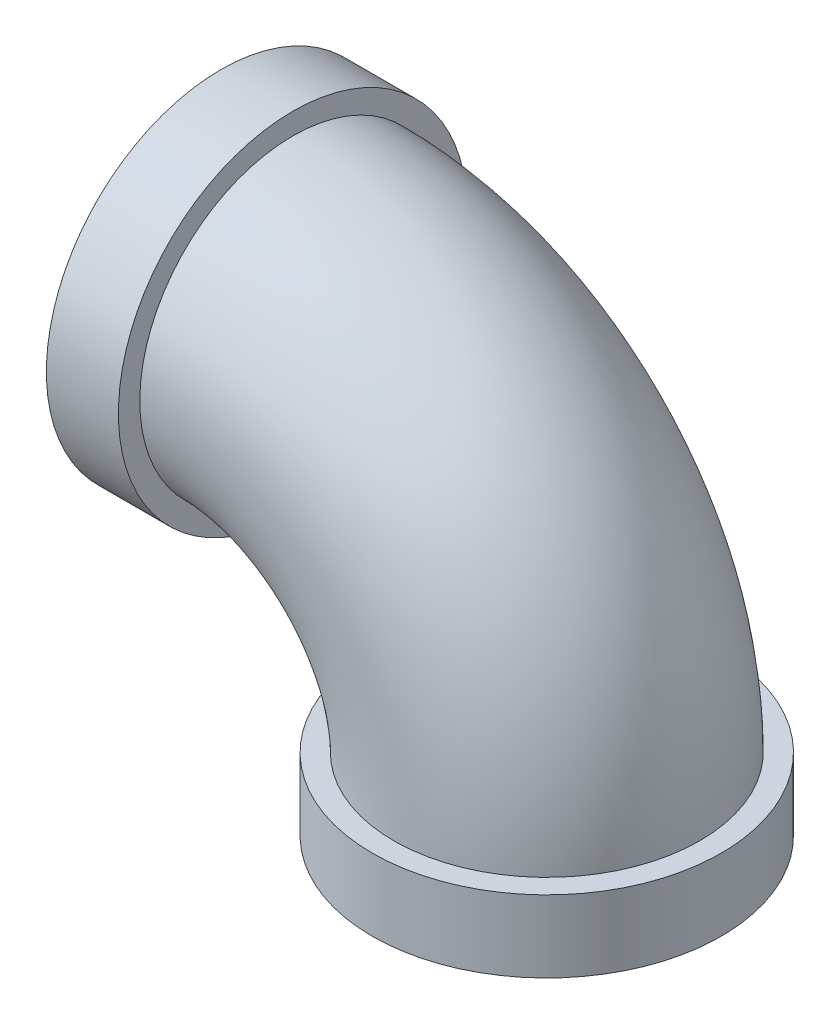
ISO-10303-21;
HEADER;
FILE_DESCRIPTION(('STEP AP214'),'2;1');
FILE_NAME('part.step','',(''),(''),'','','');
FILE_SCHEMA(('AUTOMOTIVE_DESIGN { 1 0 10303 214 1 1 1 1 }'));
ENDSEC;
DATA;
#1=APPLICATION_CONTEXT('core data for automotive mechanical design processes');
#2=APPLICATION_PROTOCOL_DEFINITION('international standard','automotive_design',2000,#1);
#3=PRODUCT_CONTEXT('',#1,'mechanical');
#4=PRODUCT('Part','Part','',(#3));
#5=PRODUCT_RELATED_PRODUCT_CATEGORY('part','',(#4));
#6=PRODUCT_DEFINITION_FORMATION('','',#4);
#7=PRODUCT_DEFINITION_CONTEXT('part definition',#1,'design');
#8=PRODUCT_DEFINITION('design','',#6,#7);
#9=PRODUCT_DEFINITION_SHAPE('','',#8);
#10=(LENGTH_UNIT() NAMED_UNIT(*) SI_UNIT(.MILLI.,.METRE.));
#11=(NAMED_UNIT(*) PLANE_ANGLE_UNIT() SI_UNIT($,.RADIAN.));
#12=(NAMED_UNIT(*) SI_UNIT($,.STERADIAN.) SOLID_ANGLE_UNIT());
#13=UNCERTAINTY_MEASURE_WITH_UNIT(LENGTH_MEASURE(1.E-05),#10,'distance_accuracy_value','');
#14=(GEOMETRIC_REPRESENTATION_CONTEXT(3) GLOBAL_UNCERTAINTY_ASSIGNED_CONTEXT((#13)) GLOBAL_UNIT_ASSIGNED_CONTEXT((#10,
#11,#12)) REPRESENTATION_CONTEXT('',''));
#15=CARTESIAN_POINT('',(0.,0.,0.));
#16=DIRECTION('',(0.,0.,1.));
#17=DIRECTION('',(1.,0.,0.));
#18=AXIS2_PLACEMENT_3D('',#15,#16,#17);
#19=CARTESIAN_POINT('',(0.,0.,0.));
#20=DIRECTION('',(0.,0.,-1.));
#21=DIRECTION('',(-1.,0.,0.));
#22=AXIS2_PLACEMENT_3D('',#19,#20,#21);
#23=TOROIDAL_SURFACE('',#22,22.1234,7.62);
#24=CARTESIAN_POINT('',(0.,22.1234,0.));
#25=DIRECTION('',(-1.,0.,0.));
#26=DIRECTION('',(0.,-1.,0.));
#27=AXIS2_PLACEMENT_3D('',#24,#25,#26);
#28=CIRCLE('',#27,7.62);
#29=CARTESIAN_POINT('',(-1.10452887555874E-13,29.7434,0.));
#30=VERTEX_POINT('',#29);
#31=EDGE_CURVE('E63',#30,#30,#28,.T.);
#32=CARTESIAN_POINT('',(22.1234,0.,0.));
#33=DIRECTION('',(0.,-1.,0.));
#34=DIRECTION('',(0.,0.,-1.));
#35=AXIS2_PLACEMENT_3D('',#32,#33,#34);
#36=CIRCLE('',#35,7.62);
#37=CARTESIAN_POINT('',(29.7434,0.,0.));
#38=VERTEX_POINT('',#37);
#39=EDGE_CURVE('E49',#38,#38,#36,.T.);
#40=CARTESIAN_POINT('',(0.,0.,0.));
#41=DIRECTION('',(0.,0.,-1.));
#42=DIRECTION('',(-1.,0.,0.));
#43=AXIS2_PLACEMENT_3D('',#40,#41,#42);
#44=CIRCLE('',#43,29.7434);
#45=EDGE_CURVE('',#30,#38,#44,.T.);
#46=ORIENTED_EDGE('',*,*,#31,.T.);
#47=ORIENTED_EDGE('',*,*,#39,.T.);
#48=ORIENTED_EDGE('',*,*,#45,.T.);
#49=ORIENTED_EDGE('',*,*,#45,.F.);
#50=EDGE_LOOP('',(#46,#48,#47,#49));
#51=FACE_BOUND('',#50,.T.);
#52=ADVANCED_FACE('F30',(#51),#23,.F.);
#53=CARTESIAN_POINT('',(0.,0.,0.));
#54=DIRECTION('',(0.,0.,-1.));
#55=DIRECTION('',(-1.,0.,0.));
#56=AXIS2_PLACEMENT_3D('',#53,#54,#55);
#57=TOROIDAL_SURFACE('',#56,22.1234,13.335);
#58=CARTESIAN_POINT('',(0.,22.1234,0.));
#59=DIRECTION('',(-1.,0.,0.));
#60=DIRECTION('',(0.,0.,1.));
#61=AXIS2_PLACEMENT_3D('',#58,#59,#60);
#62=CIRCLE('',#61,13.335);
#63=CARTESIAN_POINT('',(-1.31675688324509E-13,35.4584,0.));
#64=VERTEX_POINT('',#63);
#65=EDGE_CURVE('E10',#64,#64,#62,.T.);
#66=CARTESIAN_POINT('',(22.1234,0.,0.));
#67=DIRECTION('',(0.,-1.,0.));
#68=DIRECTION('',(0.,0.,-1.));
#69=AXIS2_PLACEMENT_3D('',#66,#67,#68);
#70=CIRCLE('',#69,13.335);
#71=CARTESIAN_POINT('',(35.4584,0.,0.));
#72=VERTEX_POINT('',#71);
#73=EDGE_CURVE('E37',#72,#72,#70,.T.);
#74=CARTESIAN_POINT('',(0.,0.,0.));
#75=DIRECTION('',(0.,0.,-1.));
#76=DIRECTION('',(-1.,0.,0.));
#77=AXIS2_PLACEMENT_3D('',#74,#75,#76);
#78=CIRCLE('',#77,35.4584);
#79=EDGE_CURVE('',#64,#72,#78,.T.);
#80=ORIENTED_EDGE('',*,*,#65,.F.);
#81=ORIENTED_EDGE('',*,*,#73,.F.);
#82=ORIENTED_EDGE('',*,*,#79,.T.);
#83=ORIENTED_EDGE('',*,*,#79,.F.);
#84=EDGE_LOOP('',(#80,#82,#81,#83));
#85=FACE_BOUND('',#84,.T.);
#86=ADVANCED_FACE('F32',(#85),#57,.T.);
#87=CARTESIAN_POINT('',(22.1234,-6.2738,0.));
#88=DIRECTION('',(0.,-1.,0.));
#89=DIRECTION('',(0.,0.,-1.));
#90=AXIS2_PLACEMENT_3D('',#87,#88,#89);
#91=PLANE('',#90);
#92=CARTESIAN_POINT('',(22.1234,-6.2738,0.));
#93=DIRECTION('',(0.,-1.,0.));
#94=DIRECTION('',(0.,0.,-1.));
#95=AXIS2_PLACEMENT_3D('',#92,#93,#94);
#96=CIRCLE('',#95,11.0998);
#97=CARTESIAN_POINT('',(22.1234,-6.2738,-11.0998));
#98=VERTEX_POINT('',#97);
#99=EDGE_CURVE('E56',#98,#98,#96,.T.);
#100=ORIENTED_EDGE('',*,*,#99,.F.);
#101=EDGE_LOOP('',(#100));
#102=FACE_BOUND('',#101,.T.);
#103=CARTESIAN_POINT('',(22.1234,-6.2738,0.));
#104=DIRECTION('',(0.,-1.,0.));
#105=DIRECTION('',(0.,0.,-1.));
#106=AXIS2_PLACEMENT_3D('',#103,#104,#105);
#107=CIRCLE('',#106,15.2019);
#108=CARTESIAN_POINT('',(22.1234,-6.2738,15.2019));
#109=VERTEX_POINT('',#108);
#110=EDGE_CURVE('E41',#109,#109,#107,.T.);
#111=ORIENTED_EDGE('',*,*,#110,.T.);
#112=EDGE_LOOP('',(#111));
#113=FACE_BOUND('',#112,.T.);
#114=ADVANCED_FACE('F104',(#102,#113),#91,.T.);
#115=CARTESIAN_POINT('',(22.1234,-6.2738,0.));
#116=DIRECTION('',(0.,1.,0.));
#117=DIRECTION('',(0.,0.,1.));
#118=AXIS2_PLACEMENT_3D('',#115,#116,#117);
#119=CYLINDRICAL_SURFACE('',#118,15.2019);
#120=CARTESIAN_POINT('',(22.1234,0.,0.));
#121=DIRECTION('',(0.,-1.,0.));
#122=DIRECTION('',(0.,0.,-1.));
#123=AXIS2_PLACEMENT_3D('',#120,#121,#122);
#124=CIRCLE('',#123,15.2019);
#125=CARTESIAN_POINT('',(22.1234,0.,15.2019));
#126=VERTEX_POINT('',#125);
#127=EDGE_CURVE('E45',#126,#126,#124,.T.);
#128=CARTESIAN_POINT('',(22.1234,-6.2738,15.2019));
#129=CARTESIAN_POINT('',(22.1234,-6.20844791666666,15.2019));
#130=CARTESIAN_POINT('',(22.1234,-6.14309583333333,15.2019));
#131=CARTESIAN_POINT('',(22.1234,-6.01239166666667,15.2019));
#132=CARTESIAN_POINT('',(22.1234,-5.94703958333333,15.2019));
#133=CARTESIAN_POINT('',(22.1234,-5.81633541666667,15.2019));
#134=CARTESIAN_POINT('',(22.1234,-5.75098333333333,15.2019));
#135=CARTESIAN_POINT('',(22.1234,-5.62027916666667,15.2019));
#136=CARTESIAN_POINT('',(22.1234,-5.55492708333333,15.2019));
#137=CARTESIAN_POINT('',(22.1234,-5.42422291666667,15.2019));
#138=CARTESIAN_POINT('',(22.1234,-5.35887083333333,15.2019));
#139=CARTESIAN_POINT('',(22.1234,-5.22816666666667,15.2019));
#140=CARTESIAN_POINT('',(22.1234,-5.16281458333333,15.2019));
#141=CARTESIAN_POINT('',(22.1234,-5.03211041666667,15.2019));
#142=CARTESIAN_POINT('',(22.1234,-4.96675833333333,15.2019));
#143=CARTESIAN_POINT('',(22.1234,-4.83605416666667,15.2019));
#144=CARTESIAN_POINT('',(22.1234,-4.77070208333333,15.2019));
#145=CARTESIAN_POINT('',(22.1234,-4.63999791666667,15.2019));
#146=CARTESIAN_POINT('',(22.1234,-4.57464583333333,15.2019));
#147=CARTESIAN_POINT('',(22.1234,-4.44394166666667,15.2019));
#148=CARTESIAN_POINT('',(22.1234,-4.37858958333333,15.2019));
#149=CARTESIAN_POINT('',(22.1234,-4.24788541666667,15.2019));
#150=CARTESIAN_POINT('',(22.1234,-4.18253333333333,15.2019));
#151=CARTESIAN_POINT('',(22.1234,-4.05182916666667,15.2019));
#152=CARTESIAN_POINT('',(22.1234,-3.98647708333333,15.2019));
#153=CARTESIAN_POINT('',(22.1234,-3.85577291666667,15.2019));
#154=CARTESIAN_POINT('',(22.1234,-3.79042083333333,15.2019));
#155=CARTESIAN_POINT('',(22.1234,-3.65971666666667,15.2019));
#156=CARTESIAN_POINT('',(22.1234,-3.59436458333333,15.2019));
#157=CARTESIAN_POINT('',(22.1234,-3.46366041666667,15.2019));
#158=CARTESIAN_POINT('',(22.1234,-3.39830833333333,15.2019));
#159=CARTESIAN_POINT('',(22.1234,-3.26760416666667,15.2019));
#160=CARTESIAN_POINT('',(22.1234,-3.20225208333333,15.2019));
#161=CARTESIAN_POINT('',(22.1234,-3.07154791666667,15.2019));
#162=CARTESIAN_POINT('',(22.1234,-3.00619583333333,15.2019));
#163=CARTESIAN_POINT('',(22.1234,-2.87549166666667,15.2019));
#164=CARTESIAN_POINT('',(22.1234,-2.81013958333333,15.2019));
#165=CARTESIAN_POINT('',(22.1234,-2.67943541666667,15.2019));
#166=CARTESIAN_POINT('',(22.1234,-2.61408333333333,15.2019));
#167=CARTESIAN_POINT('',(22.1234,-2.48337916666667,15.2019));
#168=CARTESIAN_POINT('',(22.1234,-2.41802708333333,15.2019));
#169=CARTESIAN_POINT('',(22.1234,-2.28732291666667,15.2019));
#170=CARTESIAN_POINT('',(22.1234,-2.22197083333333,15.2019));
#171=CARTESIAN_POINT('',(22.1234,-2.09126666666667,15.2019));
#172=CARTESIAN_POINT('',(22.1234,-2.02591458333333,15.2019));
#173=CARTESIAN_POINT('',(22.1234,-1.89521041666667,15.2019));
#174=CARTESIAN_POINT('',(22.1234,-1.82985833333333,15.2019));
#175=CARTESIAN_POINT('',(22.1234,-1.69915416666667,15.2019));
#176=CARTESIAN_POINT('',(22.1234,-1.63380208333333,15.2019));
#177=CARTESIAN_POINT('',(22.1234,-1.50309791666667,15.2019));
#178=CARTESIAN_POINT('',(22.1234,-1.43774583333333,15.2019));
#179=CARTESIAN_POINT('',(22.1234,-1.30704166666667,15.2019));
#180=CARTESIAN_POINT('',(22.1234,-1.24168958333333,15.2019));
#181=CARTESIAN_POINT('',(22.1234,-1.11098541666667,15.2019));
#182=CARTESIAN_POINT('',(22.1234,-1.04563333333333,15.2019));
#183=CARTESIAN_POINT('',(22.1234,-0.914929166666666,15.2019));
#184=CARTESIAN_POINT('',(22.1234,-0.849577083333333,15.2019));
#185=CARTESIAN_POINT('',(22.1234,-0.718872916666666,15.2019));
#186=CARTESIAN_POINT('',(22.1234,-0.653520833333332,15.2019));
#187=CARTESIAN_POINT('',(22.1234,-0.522816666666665,15.2019));
#188=CARTESIAN_POINT('',(22.1234,-0.457464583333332,15.2019));
#189=CARTESIAN_POINT('',(22.1234,-0.326760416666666,15.2019));
#190=CARTESIAN_POINT('',(22.1234,-0.261408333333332,15.2019));
#191=CARTESIAN_POINT('',(22.1234,-0.130704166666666,15.2019));
#192=CARTESIAN_POINT('',(22.1234,-0.0653520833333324,15.2019));
#193=CARTESIAN_POINT('',(22.1234,0.,15.2019));
#194=B_SPLINE_CURVE_WITH_KNOTS('',3,(#128,#129,#130,#131,#132,#133,#134,#135,#136,#137,#138,
#139,#140,#141,#142,#143,#144,#145,#146,#147,#148,#149,#150,#151,#152,#153,#154,#155,#156,#157,
#158,#159,#160,#161,#162,#163,#164,#165,#166,#167,#168,#169,#170,#171,#172,#173,#174,#175,#176,
#177,#178,#179,#180,#181,#182,#183,#184,#185,#186,#187,#188,#189,#190,#191,#192,#193),
.UNSPECIFIED.,.F.,.F.,(4,2,2,2,2,2,2,2,2,2,2,2,2,2,2,2,2,2,2,2,2,2,2,2,2,2,2,2,2,2,2,2,4),(0.,
0.19605625,0.3921125,0.58816875,0.784225,0.980281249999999,1.1763375,1.37239375,1.56845,
1.76450625,1.9605625,2.15661875,2.352675,2.54873125,2.7447875,2.94084375,3.1369,3.33295625,
3.5290125,3.72506875,3.921125,4.11718125,4.3132375,4.50929375,4.70535,4.90140625,5.0974625,
5.29351875,5.489575,5.68563125,5.8816875,6.07774375,6.2738),.UNSPECIFIED.);
#195=EDGE_CURVE('BSEAM108',#109,#126,#194,.T.);
#196=ORIENTED_EDGE('',*,*,#110,.F.);
#197=ORIENTED_EDGE('',*,*,#127,.T.);
#198=ORIENTED_EDGE('',*,*,#195,.T.);
#199=ORIENTED_EDGE('',*,*,#195,.F.);
#200=EDGE_LOOP('',(#196,#198,#197,#199));
#201=FACE_BOUND('',#200,.T.);
#202=ADVANCED_FACE('F108',(#201),#119,.T.);
#203=CARTESIAN_POINT('',(22.1234,0.,0.));
#204=DIRECTION('',(0.,-1.,0.));
#205=DIRECTION('',(0.,0.,-1.));
#206=AXIS2_PLACEMENT_3D('',#203,#204,#205);
#207=PLANE('',#206);
#208=ORIENTED_EDGE('',*,*,#127,.F.);
#209=EDGE_LOOP('',(#208));
#210=FACE_BOUND('',#209,.T.);
#211=ORIENTED_EDGE('',*,*,#73,.T.);
#212=EDGE_LOOP('',(#211));
#213=FACE_BOUND('',#212,.T.);
#214=ADVANCED_FACE('F111',(#210,#213),#207,.F.);
#215=CARTESIAN_POINT('',(22.1234,31.3949753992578,0.));
#216=DIRECTION('',(0.,-1.,0.));
#217=DIRECTION('',(0.,0.,-1.));
#218=AXIS2_PLACEMENT_3D('',#215,#216,#217);
#219=CYLINDRICAL_SURFACE('',#218,11.0998);
#220=CARTESIAN_POINT('',(22.1234,0.,0.));
#221=DIRECTION('',(0.,-1.,0.));
#222=DIRECTION('',(0.,0.,-1.));
#223=AXIS2_PLACEMENT_3D('',#220,#221,#222);
#224=CIRCLE('',#223,11.0998);
#225=CARTESIAN_POINT('',(22.1234,0.,-11.0998));
#226=VERTEX_POINT('',#225);
#227=EDGE_CURVE('E53',#226,#226,#224,.F.);
#228=ORIENTED_EDGE('',*,*,#227,.T.);
#229=EDGE_LOOP('',(#228));
#230=FACE_BOUND('',#229,.T.);
#231=ORIENTED_EDGE('',*,*,#99,.T.);
#232=EDGE_LOOP('',(#231));
#233=FACE_BOUND('',#232,.T.);
#234=ADVANCED_FACE('F115',(#230,#233),#219,.F.);
#235=CARTESIAN_POINT('',(22.1234,0.,0.));
#236=DIRECTION('',(0.,-1.,0.));
#237=DIRECTION('',(0.,0.,-1.));
#238=AXIS2_PLACEMENT_3D('',#235,#236,#237);
#239=PLANE('',#238);
#240=ORIENTED_EDGE('',*,*,#39,.F.);
#241=EDGE_LOOP('',(#240));
#242=FACE_BOUND('',#241,.T.);
#243=ORIENTED_EDGE('',*,*,#227,.F.);
#244=EDGE_LOOP('',(#243));
#245=FACE_BOUND('',#244,.T.);
#246=ADVANCED_FACE('F81',(#242,#245),#239,.T.);
#247=CARTESIAN_POINT('',(-6.27380000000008,22.1234,0.));
#248=DIRECTION('',(-1.,0.,0.));
#249=DIRECTION('',(0.,-1.,0.));
#250=AXIS2_PLACEMENT_3D('',#247,#248,#249);
#251=PLANE('',#250);
#252=CARTESIAN_POINT('',(-6.27380000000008,22.1234,0.));
#253=DIRECTION('',(-1.,0.,0.));
#254=DIRECTION('',(0.,-1.,0.));
#255=AXIS2_PLACEMENT_3D('',#252,#253,#254);
#256=CIRCLE('',#255,11.0998);
#257=CARTESIAN_POINT('',(-6.27380000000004,11.0236,0.));
#258=VERTEX_POINT('',#257);
#259=EDGE_CURVE('E71',#258,#258,#256,.T.);
#260=ORIENTED_EDGE('',*,*,#259,.F.);
#261=EDGE_LOOP('',(#260));
#262=FACE_BOUND('',#261,.T.);
#263=CARTESIAN_POINT('',(-6.27380000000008,22.1234,0.));
#264=DIRECTION('',(-1.,0.,0.));
#265=DIRECTION('',(0.,-1.,0.));
#266=AXIS2_PLACEMENT_3D('',#263,#264,#265);
#267=CIRCLE('',#266,15.2019);
#268=CARTESIAN_POINT('',(-6.27380000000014,37.3253,0.));
#269=VERTEX_POINT('',#268);
#270=EDGE_CURVE('E59',#269,#269,#267,.T.);
#271=ORIENTED_EDGE('',*,*,#270,.T.);
#272=EDGE_LOOP('',(#271));
#273=FACE_BOUND('',#272,.T.);
#274=ADVANCED_FACE('F77',(#262,#273),#251,.T.);
#275=CARTESIAN_POINT('',(-6.27380000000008,22.1234,0.));
#276=DIRECTION('',(1.,0.,0.));
#277=DIRECTION('',(0.,1.,0.));
#278=AXIS2_PLACEMENT_3D('',#275,#276,#277);
#279=CYLINDRICAL_SURFACE('',#278,15.2019);
#280=CARTESIAN_POINT('',(0.,22.1234,0.));
#281=DIRECTION('',(-1.,0.,0.));
#282=DIRECTION('',(0.,-1.,0.));
#283=AXIS2_PLACEMENT_3D('',#280,#281,#282);
#284=CIRCLE('',#283,15.2019);
#285=CARTESIAN_POINT('',(-1.37910516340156E-13,37.3253,0.));
#286=VERTEX_POINT('',#285);
#287=EDGE_CURVE('E60',#286,#286,#284,.T.);
#288=CARTESIAN_POINT('',(-6.27380000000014,37.3253,0.));
#289=CARTESIAN_POINT('',(-6.20844791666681,37.3253,0.));
#290=CARTESIAN_POINT('',(-6.14309583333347,37.3253,0.));
#291=CARTESIAN_POINT('',(-6.0123916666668,37.3253,0.));
#292=CARTESIAN_POINT('',(-5.94703958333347,37.3253,0.));
#293=CARTESIAN_POINT('',(-5.8163354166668,37.3253,0.));
#294=CARTESIAN_POINT('',(-5.75098333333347,37.3253,0.));
#295=CARTESIAN_POINT('',(-5.6202791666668,37.3253,0.));
#296=CARTESIAN_POINT('',(-5.55492708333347,37.3253,0.));
#297=CARTESIAN_POINT('',(-5.42422291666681,37.3253,0.));
#298=CARTESIAN_POINT('',(-5.35887083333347,37.3253,0.));
#299=CARTESIAN_POINT('',(-5.22816666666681,37.3253,0.));
#300=CARTESIAN_POINT('',(-5.16281458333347,37.3253,0.));
#301=CARTESIAN_POINT('',(-5.03211041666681,37.3253,0.));
#302=CARTESIAN_POINT('',(-4.96675833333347,37.3253,0.));
#303=CARTESIAN_POINT('',(-4.8360541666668,37.3253,0.));
#304=CARTESIAN_POINT('',(-4.77070208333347,37.3253,0.));
#305=CARTESIAN_POINT('',(-4.6399979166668,37.3253,0.));
#306=CARTESIAN_POINT('',(-4.57464583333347,37.3253,0.));
#307=CARTESIAN_POINT('',(-4.44394166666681,37.3253,0.));
#308=CARTESIAN_POINT('',(-4.37858958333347,37.3253,0.));
#309=CARTESIAN_POINT('',(-4.24788541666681,37.3253,0.));
#310=CARTESIAN_POINT('',(-4.18253333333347,37.3253,0.));
#311=CARTESIAN_POINT('',(-4.0518291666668,37.3253,0.));
#312=CARTESIAN_POINT('',(-3.98647708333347,37.3253,0.));
#313=CARTESIAN_POINT('',(-3.85577291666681,37.3253,0.));
#314=CARTESIAN_POINT('',(-3.79042083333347,37.3253,0.));
#315=CARTESIAN_POINT('',(-3.6597166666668,37.3253,0.));
#316=CARTESIAN_POINT('',(-3.59436458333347,37.3253,0.));
#317=CARTESIAN_POINT('',(-3.4636604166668,37.3253,0.));
#318=CARTESIAN_POINT('',(-3.39830833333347,37.3253,0.));
#319=CARTESIAN_POINT('',(-3.2676041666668,37.3253,0.));
#320=CARTESIAN_POINT('',(-3.20225208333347,37.3253,0.));
#321=CARTESIAN_POINT('',(-3.0715479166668,37.3253,0.));
#322=CARTESIAN_POINT('',(-3.00619583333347,37.3253,0.));
#323=CARTESIAN_POINT('',(-2.8754916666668,37.3253,0.));
#324=CARTESIAN_POINT('',(-2.81013958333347,37.3253,0.));
#325=CARTESIAN_POINT('',(-2.6794354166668,37.3253,0.));
#326=CARTESIAN_POINT('',(-2.61408333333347,37.3253,0.));
#327=CARTESIAN_POINT('',(-2.48337916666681,37.3253,0.));
#328=CARTESIAN_POINT('',(-2.41802708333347,37.3253,0.));
#329=CARTESIAN_POINT('',(-2.28732291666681,37.3253,0.));
#330=CARTESIAN_POINT('',(-2.22197083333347,37.3253,0.));
#331=CARTESIAN_POINT('',(-2.0912666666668,37.3253,0.));
#332=CARTESIAN_POINT('',(-2.02591458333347,37.3253,0.));
#333=CARTESIAN_POINT('',(-1.89521041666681,37.3253,0.));
#334=CARTESIAN_POINT('',(-1.82985833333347,37.3253,0.));
#335=CARTESIAN_POINT('',(-1.69915416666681,37.3253,0.));
#336=CARTESIAN_POINT('',(-1.63380208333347,37.3253,0.));
#337=CARTESIAN_POINT('',(-1.50309791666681,37.3253,0.));
#338=CARTESIAN_POINT('',(-1.43774583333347,37.3253,0.));
#339=CARTESIAN_POINT('',(-1.30704166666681,37.3253,0.));
#340=CARTESIAN_POINT('',(-1.24168958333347,37.3253,0.));
#341=CARTESIAN_POINT('',(-1.1109854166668,37.3253,0.));
#342=CARTESIAN_POINT('',(-1.04563333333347,37.3253,0.));
#343=CARTESIAN_POINT('',(-0.914929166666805,37.3253,0.));
#344=CARTESIAN_POINT('',(-0.849577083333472,37.3253,0.));
#345=CARTESIAN_POINT('',(-0.718872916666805,37.3253,0.));
#346=CARTESIAN_POINT('',(-0.653520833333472,37.3253,0.));
#347=CARTESIAN_POINT('',(-0.522816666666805,37.3253,0.));
#348=CARTESIAN_POINT('',(-0.457464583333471,37.3253,0.));
#349=CARTESIAN_POINT('',(-0.326760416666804,37.3253,0.));
#350=CARTESIAN_POINT('',(-0.261408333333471,37.3253,0.));
#351=CARTESIAN_POINT('',(-0.130704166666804,37.3253,0.));
#352=CARTESIAN_POINT('',(-0.0653520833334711,37.3253,0.));
#353=CARTESIAN_POINT('',(-1.37910516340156E-13,37.3253,0.));
#354=B_SPLINE_CURVE_WITH_KNOTS('',3,(#288,#289,#290,#291,#292,#293,#294,#295,#296,#297,#298,
#299,#300,#301,#302,#303,#304,#305,#306,#307,#308,#309,#310,#311,#312,#313,#314,#315,#316,#317,
#318,#319,#320,#321,#322,#323,#324,#325,#326,#327,#328,#329,#330,#331,#332,#333,#334,#335,#336,
#337,#338,#339,#340,#341,#342,#343,#344,#345,#346,#347,#348,#349,#350,#351,#352,#353),
.UNSPECIFIED.,.F.,.F.,(4,2,2,2,2,2,2,2,2,2,2,2,2,2,2,2,2,2,2,2,2,2,2,2,2,2,2,2,2,2,2,2,4),(0.,
0.196056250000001,0.392112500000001,0.58816875,0.784225,0.98028125,1.1763375,1.37239375,1.56845,
1.76450625,1.9605625,2.15661875,2.352675,2.54873125,2.7447875,2.94084375,3.1369,3.33295625,
3.5290125,3.72506875,3.921125,4.11718125,4.3132375,4.50929375,4.70535,4.90140625,5.0974625,
5.29351875,5.489575,5.68563125,5.8816875,6.07774375,6.2738),.UNSPECIFIED.);
#355=EDGE_CURVE('BSEAM80',#269,#286,#354,.T.);
#356=ORIENTED_EDGE('',*,*,#270,.F.);
#357=ORIENTED_EDGE('',*,*,#287,.T.);
#358=ORIENTED_EDGE('',*,*,#355,.T.);
#359=ORIENTED_EDGE('',*,*,#355,.F.);
#360=EDGE_LOOP('',(#356,#358,#357,#359));
#361=FACE_BOUND('',#360,.T.);
#362=ADVANCED_FACE('F80',(#361),#279,.T.);
#363=CARTESIAN_POINT('',(0.,22.1234,0.));
#364=DIRECTION('',(-1.,0.,0.));
#365=DIRECTION('',(0.,-1.,0.));
#366=AXIS2_PLACEMENT_3D('',#363,#364,#365);
#367=PLANE('',#366);
#368=ORIENTED_EDGE('',*,*,#287,.F.);
#369=EDGE_LOOP('',(#368));
#370=FACE_BOUND('',#369,.T.);
#371=ORIENTED_EDGE('',*,*,#65,.T.);
#372=EDGE_LOOP('',(#371));
#373=FACE_BOUND('',#372,.T.);
#374=ADVANCED_FACE('F87',(#370,#373),#367,.F.);
#375=CARTESIAN_POINT('',(31.3949753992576,22.1234000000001,0.));
#376=DIRECTION('',(-1.,0.,0.));
#377=DIRECTION('',(0.,-1.,0.));
#378=AXIS2_PLACEMENT_3D('',#375,#376,#377);
#379=CYLINDRICAL_SURFACE('',#378,11.0998);
#380=CARTESIAN_POINT('',(0.,22.1234,0.));
#381=DIRECTION('',(-1.,0.,0.));
#382=DIRECTION('',(0.,-1.,0.));
#383=AXIS2_PLACEMENT_3D('',#380,#381,#382);
#384=CIRCLE('',#383,11.0998);
#385=CARTESIAN_POINT('',(0.,11.0236,0.));
#386=VERTEX_POINT('',#385);
#387=EDGE_CURVE('E68',#386,#386,#384,.F.);
#388=ORIENTED_EDGE('',*,*,#387,.T.);
#389=EDGE_LOOP('',(#388));
#390=FACE_BOUND('',#389,.T.);
#391=ORIENTED_EDGE('',*,*,#259,.T.);
#392=EDGE_LOOP('',(#391));
#393=FACE_BOUND('',#392,.T.);
#394=ADVANCED_FACE('F75',(#390,#393),#379,.F.);
#395=CARTESIAN_POINT('',(0.,22.1234,0.));
#396=DIRECTION('',(-1.,0.,0.));
#397=DIRECTION('',(0.,-1.,0.));
#398=AXIS2_PLACEMENT_3D('',#395,#396,#397);
#399=PLANE('',#398);
#400=ORIENTED_EDGE('',*,*,#31,.F.);
#401=EDGE_LOOP('',(#400));
#402=FACE_BOUND('',#401,.T.);
#403=ORIENTED_EDGE('',*,*,#387,.F.);
#404=EDGE_LOOP('',(#403));
#405=FACE_BOUND('',#404,.T.);
#406=ADVANCED_FACE('F96',(#402,#405),#399,.T.);
#407=CLOSED_SHELL('',(#52,#86,#114,#202,#214,#234,#246,#274,#362,#374,#394,#406));
#408=MANIFOLD_SOLID_BREP('B2',#407);
#409=ADVANCED_BREP_SHAPE_REPRESENTATION('',(#18,#408),#14);
#410=SHAPE_DEFINITION_REPRESENTATION(#9,#409);
ENDSEC;
END-ISO-10303-21;
